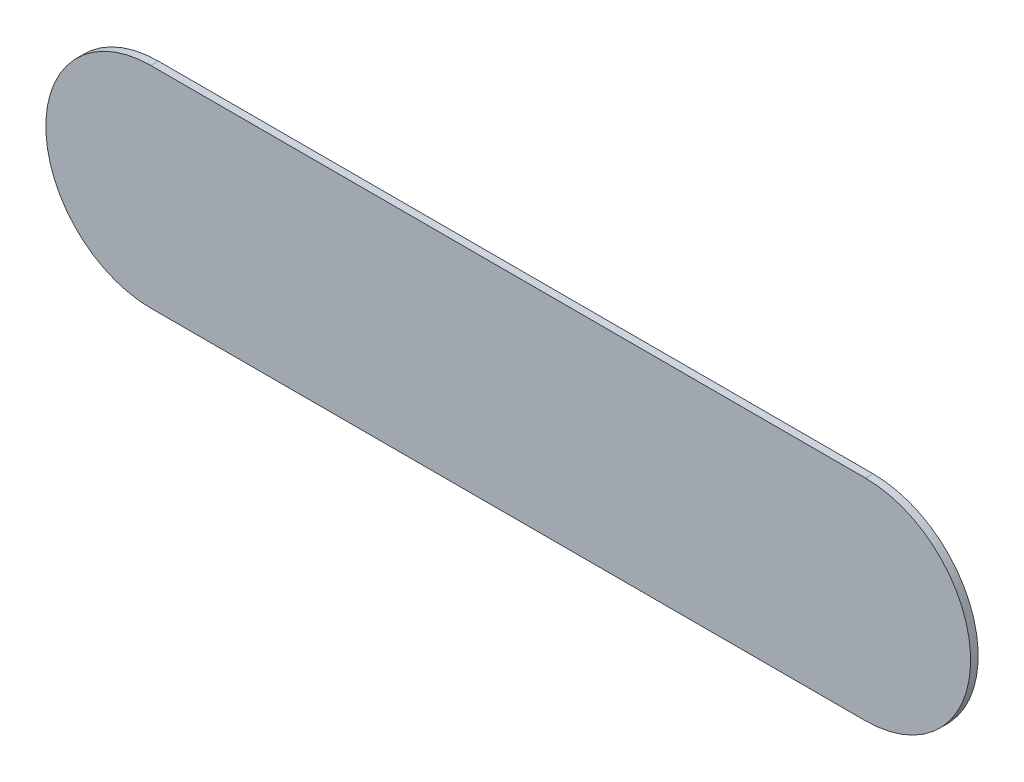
ISO-10303-21;
HEADER;
FILE_DESCRIPTION(('STEP AP214'),'2;1');
FILE_NAME('part.step','',(''),(''),'','','');
FILE_SCHEMA(('AUTOMOTIVE_DESIGN { 1 0 10303 214 1 1 1 1 }'));
ENDSEC;
DATA;
#1=APPLICATION_CONTEXT('core data for automotive mechanical design processes');
#2=APPLICATION_PROTOCOL_DEFINITION('international standard','automotive_design',2000,#1);
#3=PRODUCT_CONTEXT('',#1,'mechanical');
#4=PRODUCT('Part','Part','',(#3));
#5=PRODUCT_RELATED_PRODUCT_CATEGORY('part','',(#4));
#6=PRODUCT_DEFINITION_FORMATION('','',#4);
#7=PRODUCT_DEFINITION_CONTEXT('part definition',#1,'design');
#8=PRODUCT_DEFINITION('design','',#6,#7);
#9=PRODUCT_DEFINITION_SHAPE('','',#8);
#10=(LENGTH_UNIT() NAMED_UNIT(*) SI_UNIT(.MILLI.,.METRE.));
#11=(NAMED_UNIT(*) PLANE_ANGLE_UNIT() SI_UNIT($,.RADIAN.));
#12=(NAMED_UNIT(*) SI_UNIT($,.STERADIAN.) SOLID_ANGLE_UNIT());
#13=UNCERTAINTY_MEASURE_WITH_UNIT(LENGTH_MEASURE(1.E-05),#10,'distance_accuracy_value','');
#14=(GEOMETRIC_REPRESENTATION_CONTEXT(3) GLOBAL_UNCERTAINTY_ASSIGNED_CONTEXT((#13)) GLOBAL_UNIT_ASSIGNED_CONTEXT((#10,
#11,#12)) REPRESENTATION_CONTEXT('',''));
#15=CARTESIAN_POINT('',(0.,0.,0.));
#16=DIRECTION('',(0.,0.,1.));
#17=DIRECTION('',(1.,0.,0.));
#18=AXIS2_PLACEMENT_3D('',#15,#16,#17);
#19=CARTESIAN_POINT('',(850.,-1.11022302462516E-13,18.));
#20=DIRECTION('',(0.,0.,-1.));
#21=DIRECTION('',(-1.,0.,0.));
#22=AXIS2_PLACEMENT_3D('',#19,#20,#21);
#23=CYLINDRICAL_SURFACE('',#22,250.);
#24=CARTESIAN_POINT('',(850.,-1.11022302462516E-13,0.));
#25=DIRECTION('',(0.,0.,1.));
#26=DIRECTION('',(1.,0.,0.));
#27=AXIS2_PLACEMENT_3D('',#24,#25,#26);
#28=CIRCLE('',#27,250.);
#29=CARTESIAN_POINT('',(850.,-250.,0.));
#30=VERTEX_POINT('',#29);
#31=CARTESIAN_POINT('',(850.,250.,0.));
#32=VERTEX_POINT('',#31);
#33=EDGE_CURVE('E95',#30,#32,#28,.T.);
#34=ORIENTED_EDGE('',*,*,#33,.T.);
#35=DIRECTION('',(0.,0.,-1.));
#36=VECTOR('',#35,1.);
#37=CARTESIAN_POINT('',(850.,250.,18.));
#38=LINE('',#37,#36);
#39=CARTESIAN_POINT('',(850.,250.,18.));
#40=VERTEX_POINT('',#39);
#41=EDGE_CURVE('E11',#40,#32,#38,.T.);
#42=ORIENTED_EDGE('',*,*,#41,.F.);
#43=CARTESIAN_POINT('',(850.,-1.11022302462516E-13,18.));
#44=DIRECTION('',(0.,0.,1.));
#45=DIRECTION('',(1.,0.,0.));
#46=AXIS2_PLACEMENT_3D('',#43,#44,#45);
#47=CIRCLE('',#46,250.);
#48=CARTESIAN_POINT('',(850.,-250.,18.));
#49=VERTEX_POINT('',#48);
#50=EDGE_CURVE('E83',#49,#40,#47,.T.);
#51=ORIENTED_EDGE('',*,*,#50,.F.);
#52=DIRECTION('',(0.,0.,-1.));
#53=VECTOR('',#52,1.);
#54=CARTESIAN_POINT('',(850.,-250.,18.));
#55=LINE('',#54,#53);
#56=EDGE_CURVE('E91',#49,#30,#55,.T.);
#57=ORIENTED_EDGE('',*,*,#56,.T.);
#58=EDGE_LOOP('',(#34,#42,#51,#57));
#59=FACE_BOUND('',#58,.T.);
#60=ADVANCED_FACE('F32',(#59),#23,.T.);
#61=CARTESIAN_POINT('',(-850.000000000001,250.,18.));
#62=DIRECTION('',(0.,-1.,0.));
#63=DIRECTION('',(0.,0.,-1.));
#64=AXIS2_PLACEMENT_3D('',#61,#62,#63);
#65=PLANE('',#64);
#66=DIRECTION('',(-1.,0.,0.));
#67=VECTOR('',#66,1.);
#68=CARTESIAN_POINT('',(-850.000000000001,250.,0.));
#69=LINE('',#68,#67);
#70=CARTESIAN_POINT('',(-850.000000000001,250.,0.));
#71=VERTEX_POINT('',#70);
#72=EDGE_CURVE('E87',#32,#71,#69,.T.);
#73=ORIENTED_EDGE('',*,*,#72,.T.);
#74=DIRECTION('',(0.,0.,-1.));
#75=VECTOR('',#74,1.);
#76=CARTESIAN_POINT('',(-850.000000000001,250.,18.));
#77=LINE('',#76,#75);
#78=CARTESIAN_POINT('',(-850.000000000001,250.,18.));
#79=VERTEX_POINT('',#78);
#80=EDGE_CURVE('E40',#79,#71,#77,.T.);
#81=ORIENTED_EDGE('',*,*,#80,.F.);
#82=DIRECTION('',(-1.,0.,0.));
#83=VECTOR('',#82,1.);
#84=CARTESIAN_POINT('',(-850.000000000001,250.,18.));
#85=LINE('',#84,#83);
#86=EDGE_CURVE('E78',#40,#79,#85,.T.);
#87=ORIENTED_EDGE('',*,*,#86,.F.);
#88=ORIENTED_EDGE('',*,*,#41,.T.);
#89=EDGE_LOOP('',(#73,#81,#87,#88));
#90=FACE_BOUND('',#89,.T.);
#91=ADVANCED_FACE('F86',(#90),#65,.F.);
#92=CARTESIAN_POINT('',(-850.000000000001,-1.11022302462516E-13,18.));
#93=DIRECTION('',(0.,0.,-1.));
#94=DIRECTION('',(-1.,0.,0.));
#95=AXIS2_PLACEMENT_3D('',#92,#93,#94);
#96=CYLINDRICAL_SURFACE('',#95,250.);
#97=CARTESIAN_POINT('',(-850.000000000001,-1.11022302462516E-13,0.));
#98=DIRECTION('',(0.,0.,1.));
#99=DIRECTION('',(1.,0.,0.));
#100=AXIS2_PLACEMENT_3D('',#97,#98,#99);
#101=CIRCLE('',#100,250.);
#102=CARTESIAN_POINT('',(-850.000000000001,-250.,0.));
#103=VERTEX_POINT('',#102);
#104=EDGE_CURVE('E65',#71,#103,#101,.T.);
#105=ORIENTED_EDGE('',*,*,#104,.T.);
#106=DIRECTION('',(0.,0.,-1.));
#107=VECTOR('',#106,1.);
#108=CARTESIAN_POINT('',(-850.000000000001,-250.,18.));
#109=LINE('',#108,#107);
#110=CARTESIAN_POINT('',(-850.000000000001,-250.,18.));
#111=VERTEX_POINT('',#110);
#112=EDGE_CURVE('E88',#111,#103,#109,.T.);
#113=ORIENTED_EDGE('',*,*,#112,.F.);
#114=CARTESIAN_POINT('',(-850.000000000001,-1.11022302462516E-13,18.));
#115=DIRECTION('',(0.,0.,1.));
#116=DIRECTION('',(1.,0.,0.));
#117=AXIS2_PLACEMENT_3D('',#114,#115,#116);
#118=CIRCLE('',#117,250.);
#119=EDGE_CURVE('E81',#79,#111,#118,.T.);
#120=ORIENTED_EDGE('',*,*,#119,.F.);
#121=ORIENTED_EDGE('',*,*,#80,.T.);
#122=EDGE_LOOP('',(#105,#113,#120,#121));
#123=FACE_BOUND('',#122,.T.);
#124=ADVANCED_FACE('F89',(#123),#96,.T.);
#125=CARTESIAN_POINT('',(-850.000000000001,-250.,18.));
#126=DIRECTION('',(0.,1.,0.));
#127=DIRECTION('',(0.,0.,1.));
#128=AXIS2_PLACEMENT_3D('',#125,#126,#127);
#129=PLANE('',#128);
#130=DIRECTION('',(1.,0.,0.));
#131=VECTOR('',#130,1.);
#132=CARTESIAN_POINT('',(-850.000000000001,-250.,0.));
#133=LINE('',#132,#131);
#134=EDGE_CURVE('E71',#103,#30,#133,.T.);
#135=ORIENTED_EDGE('',*,*,#134,.T.);
#136=ORIENTED_EDGE('',*,*,#56,.F.);
#137=DIRECTION('',(1.,0.,0.));
#138=VECTOR('',#137,1.);
#139=CARTESIAN_POINT('',(-850.000000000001,-250.,18.));
#140=LINE('',#139,#138);
#141=EDGE_CURVE('E48',#111,#49,#140,.T.);
#142=ORIENTED_EDGE('',*,*,#141,.F.);
#143=ORIENTED_EDGE('',*,*,#112,.T.);
#144=EDGE_LOOP('',(#135,#136,#142,#143));
#145=FACE_BOUND('',#144,.T.);
#146=ADVANCED_FACE('F102',(#145),#129,.F.);
#147=CARTESIAN_POINT('',(850.,-1.11022302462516E-13,18.));
#148=DIRECTION('',(0.,0.,1.));
#149=DIRECTION('',(1.,0.,0.));
#150=AXIS2_PLACEMENT_3D('',#147,#148,#149);
#151=PLANE('',#150);
#152=ORIENTED_EDGE('',*,*,#50,.T.);
#153=ORIENTED_EDGE('',*,*,#86,.T.);
#154=ORIENTED_EDGE('',*,*,#119,.T.);
#155=ORIENTED_EDGE('',*,*,#141,.T.);
#156=EDGE_LOOP('',(#152,#153,#154,#155));
#157=FACE_BOUND('',#156,.T.);
#158=ADVANCED_FACE('F79',(#157),#151,.T.);
#159=CARTESIAN_POINT('',(850.,-1.11022302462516E-13,0.));
#160=DIRECTION('',(0.,0.,1.));
#161=DIRECTION('',(1.,0.,0.));
#162=AXIS2_PLACEMENT_3D('',#159,#160,#161);
#163=PLANE('',#162);
#164=ORIENTED_EDGE('',*,*,#33,.F.);
#165=ORIENTED_EDGE('',*,*,#134,.F.);
#166=ORIENTED_EDGE('',*,*,#104,.F.);
#167=ORIENTED_EDGE('',*,*,#72,.F.);
#168=EDGE_LOOP('',(#164,#165,#166,#167));
#169=FACE_BOUND('',#168,.T.);
#170=ADVANCED_FACE('F105',(#169),#163,.F.);
#171=CLOSED_SHELL('',(#60,#91,#124,#146,#158,#170));
#172=MANIFOLD_SOLID_BREP('B2',#171);
#173=ADVANCED_BREP_SHAPE_REPRESENTATION('',(#18,#172),#14);
#174=SHAPE_DEFINITION_REPRESENTATION(#9,#173);
ENDSEC;
END-ISO-10303-21;
